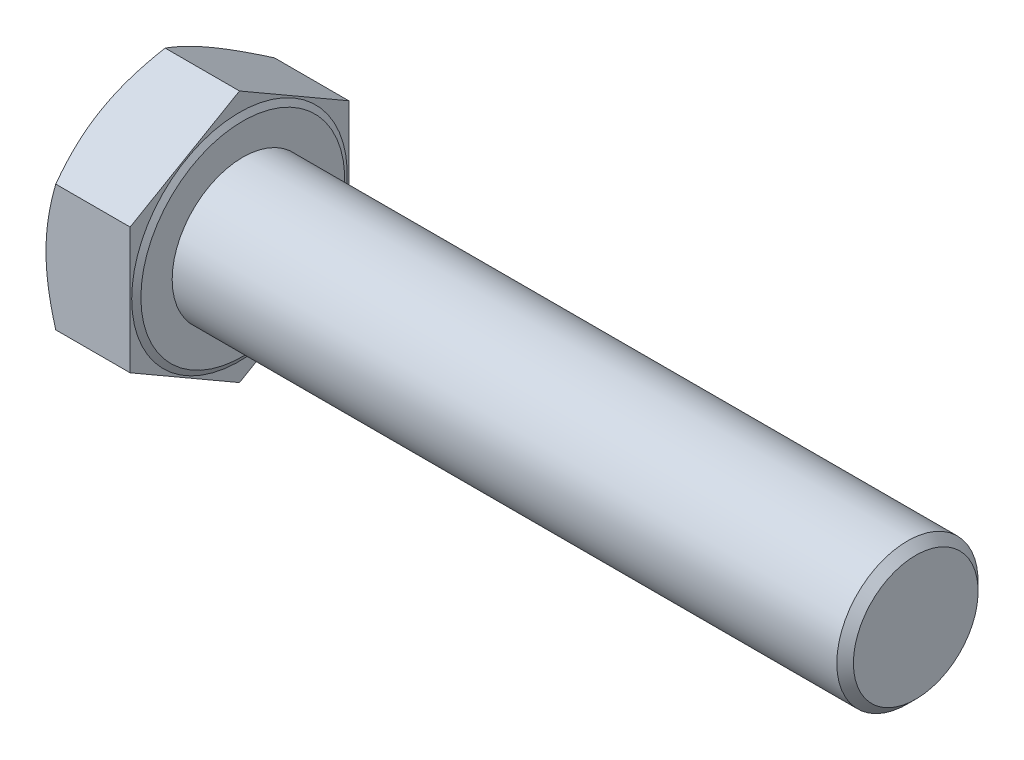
ISO-10303-21;
HEADER;
FILE_DESCRIPTION(('STEP AP214'),'2;1');
FILE_NAME('part.step','',(''),(''),'','','');
FILE_SCHEMA(('AUTOMOTIVE_DESIGN { 1 0 10303 214 1 1 1 1 }'));
ENDSEC;
DATA;
#1=APPLICATION_CONTEXT('core data for automotive mechanical design processes');
#2=APPLICATION_PROTOCOL_DEFINITION('international standard','automotive_design',2000,#1);
#3=PRODUCT_CONTEXT('',#1,'mechanical');
#4=PRODUCT('Part','Part','',(#3));
#5=PRODUCT_RELATED_PRODUCT_CATEGORY('part','',(#4));
#6=PRODUCT_DEFINITION_FORMATION('','',#4);
#7=PRODUCT_DEFINITION_CONTEXT('part definition',#1,'design');
#8=PRODUCT_DEFINITION('design','',#6,#7);
#9=PRODUCT_DEFINITION_SHAPE('','',#8);
#10=(LENGTH_UNIT() NAMED_UNIT(*) SI_UNIT(.MILLI.,.METRE.));
#11=(NAMED_UNIT(*) PLANE_ANGLE_UNIT() SI_UNIT($,.RADIAN.));
#12=(NAMED_UNIT(*) SI_UNIT($,.STERADIAN.) SOLID_ANGLE_UNIT());
#13=UNCERTAINTY_MEASURE_WITH_UNIT(LENGTH_MEASURE(1.E-05),#10,'distance_accuracy_value','');
#14=(GEOMETRIC_REPRESENTATION_CONTEXT(3) GLOBAL_UNCERTAINTY_ASSIGNED_CONTEXT((#13)) GLOBAL_UNIT_ASSIGNED_CONTEXT((#10,
#11,#12)) REPRESENTATION_CONTEXT('',''));
#15=CARTESIAN_POINT('',(0.,0.,0.));
#16=DIRECTION('',(0.,0.,1.));
#17=DIRECTION('',(1.,0.,0.));
#18=AXIS2_PLACEMENT_3D('',#15,#16,#17);
#19=CARTESIAN_POINT('',(26.,37.5277674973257,0.));
#20=DIRECTION('',(1.,0.,0.));
#21=DIRECTION('',(0.,0.,-1.));
#22=AXIS2_PLACEMENT_3D('',#19,#20,#21);
#23=PLANE('',#22);
#24=CARTESIAN_POINT('',(26.,0.,0.));
#25=DIRECTION('',(1.,0.,0.));
#26=DIRECTION('',(0.,0.,-1.));
#27=AXIS2_PLACEMENT_3D('',#24,#25,#26);
#28=CIRCLE('',#27,21.);
#29=CARTESIAN_POINT('',(26.,0.,-21.));
#30=VERTEX_POINT('',#29);
#31=EDGE_CURVE('E251',#30,#30,#28,.F.);
#32=ORIENTED_EDGE('',*,*,#31,.T.);
#33=EDGE_LOOP('',(#32));
#34=FACE_BOUND('',#33,.T.);
#35=CARTESIAN_POINT('',(26.,0.,0.));
#36=DIRECTION('',(-1.,0.,0.));
#37=DIRECTION('',(0.,0.,1.));
#38=AXIS2_PLACEMENT_3D('',#35,#36,#37);
#39=CIRCLE('',#38,30.3);
#40=CARTESIAN_POINT('',(26.,0.,30.3));
#41=VERTEX_POINT('',#40);
#42=EDGE_CURVE('E275',#41,#41,#39,.T.);
#43=ORIENTED_EDGE('',*,*,#42,.F.);
#44=EDGE_LOOP('',(#43));
#45=FACE_BOUND('',#44,.T.);
#46=ADVANCED_FACE('F32',(#34,#45),#23,.T.);
#47=CARTESIAN_POINT('',(0.,0.,0.));
#48=DIRECTION('',(-1.,0.,0.));
#49=DIRECTION('',(0.,0.,1.));
#50=AXIS2_PLACEMENT_3D('',#47,#48,#49);
#51=CYLINDRICAL_SURFACE('',#50,21.);
#52=ORIENTED_EDGE('',*,*,#31,.F.);
#53=EDGE_LOOP('',(#52));
#54=FACE_BOUND('',#53,.T.);
#55=CARTESIAN_POINT('',(223.533,0.,0.));
#56=DIRECTION('',(-1.,0.,0.));
#57=DIRECTION('',(0.,0.,1.));
#58=AXIS2_PLACEMENT_3D('',#55,#56,#57);
#59=CIRCLE('',#58,21.);
#60=CARTESIAN_POINT('',(223.533,0.,21.));
#61=VERTEX_POINT('',#60);
#62=EDGE_CURVE('E246',#61,#61,#59,.T.);
#63=ORIENTED_EDGE('',*,*,#62,.T.);
#64=EDGE_LOOP('',(#63));
#65=FACE_BOUND('',#64,.T.);
#66=ADVANCED_FACE('F232',(#54,#65),#51,.T.);
#67=CARTESIAN_POINT('',(226.,0.,0.));
#68=DIRECTION('',(-1.,0.,0.));
#69=DIRECTION('',(0.,0.,1.));
#70=AXIS2_PLACEMENT_3D('',#67,#68,#69);
#71=CONICAL_SURFACE('',#70,18.533,0.78539816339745);
#72=ORIENTED_EDGE('',*,*,#62,.F.);
#73=EDGE_LOOP('',(#72));
#74=FACE_BOUND('',#73,.T.);
#75=CARTESIAN_POINT('',(226.,0.,0.));
#76=DIRECTION('',(-1.,0.,0.));
#77=DIRECTION('',(0.,0.,1.));
#78=AXIS2_PLACEMENT_3D('',#75,#76,#77);
#79=CIRCLE('',#78,18.533);
#80=CARTESIAN_POINT('',(226.,0.,18.533));
#81=VERTEX_POINT('',#80);
#82=EDGE_CURVE('E249',#81,#81,#79,.T.);
#83=ORIENTED_EDGE('',*,*,#82,.T.);
#84=EDGE_LOOP('',(#83));
#85=FACE_BOUND('',#84,.T.);
#86=ADVANCED_FACE('F235',(#74,#85),#71,.T.);
#87=CARTESIAN_POINT('',(226.,0.,0.));
#88=DIRECTION('',(-1.,0.,0.));
#89=DIRECTION('',(0.,0.,1.));
#90=AXIS2_PLACEMENT_3D('',#87,#88,#89);
#91=PLANE('',#90);
#92=ORIENTED_EDGE('',*,*,#82,.F.);
#93=EDGE_LOOP('',(#92));
#94=FACE_BOUND('',#93,.T.);
#95=ADVANCED_FACE('F200',(#94),#91,.F.);
#96=CARTESIAN_POINT('',(25.,32.0320508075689,0.));
#97=DIRECTION('',(1.,0.,0.));
#98=DIRECTION('',(0.,0.,-1.));
#99=AXIS2_PLACEMENT_3D('',#96,#97,#98);
#100=PLANE('',#99);
#101=CARTESIAN_POINT('',(25.,0.,0.));
#102=DIRECTION('',(-1.,0.,0.));
#103=DIRECTION('',(0.,0.,1.));
#104=AXIS2_PLACEMENT_3D('',#101,#102,#103);
#105=CIRCLE('',#104,32.0320508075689);
#106=CARTESIAN_POINT('',(25.,0.,32.0320508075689));
#107=VERTEX_POINT('',#106);
#108=EDGE_CURVE('E272',#107,#107,#105,.T.);
#109=ORIENTED_EDGE('',*,*,#108,.T.);
#110=EDGE_LOOP('',(#109));
#111=FACE_BOUND('',#110,.T.);
#112=DIRECTION('',(0.,0.500000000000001,0.866025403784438));
#113=VECTOR('',#112,1.);
#114=CARTESIAN_POINT('',(25.,18.7638837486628,-32.5));
#115=LINE('',#114,#113);
#116=CARTESIAN_POINT('',(25.,18.7638837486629,-32.5));
#117=VERTEX_POINT('',#116);
#118=CARTESIAN_POINT('',(25.,37.5277674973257,0.));
#119=VERTEX_POINT('',#118);
#120=EDGE_CURVE('E109',#117,#119,#115,.T.);
#121=ORIENTED_EDGE('',*,*,#120,.T.);
#122=DIRECTION('',(0.,-0.500000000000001,0.866025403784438));
#123=VECTOR('',#122,1.);
#124=CARTESIAN_POINT('',(25.,37.5277674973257,0.));
#125=LINE('',#124,#123);
#126=CARTESIAN_POINT('',(25.,18.7638837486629,32.5));
#127=VERTEX_POINT('',#126);
#128=EDGE_CURVE('E103',#119,#127,#125,.T.);
#129=ORIENTED_EDGE('',*,*,#128,.T.);
#130=DIRECTION('',(0.,-1.,0.));
#131=VECTOR('',#130,1.);
#132=CARTESIAN_POINT('',(25.,18.7638837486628,32.5));
#133=LINE('',#132,#131);
#134=CARTESIAN_POINT('',(25.,-18.7638837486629,32.5));
#135=VERTEX_POINT('',#134);
#136=EDGE_CURVE('E106',#127,#135,#133,.T.);
#137=ORIENTED_EDGE('',*,*,#136,.T.);
#138=DIRECTION('',(0.,-0.500000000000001,-0.866025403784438));
#139=VECTOR('',#138,1.);
#140=CARTESIAN_POINT('',(25.,-37.5277674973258,0.));
#141=LINE('',#140,#139);
#142=CARTESIAN_POINT('',(25.,-37.5277674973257,-1.35308431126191E-13));
#143=VERTEX_POINT('',#142);
#144=EDGE_CURVE('E122',#135,#143,#141,.T.);
#145=ORIENTED_EDGE('',*,*,#144,.T.);
#146=DIRECTION('',(0.,0.500000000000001,-0.866025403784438));
#147=VECTOR('',#146,1.);
#148=CARTESIAN_POINT('',(25.,-18.7638837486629,-32.5));
#149=LINE('',#148,#147);
#150=CARTESIAN_POINT('',(25.,-18.7638837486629,-32.5));
#151=VERTEX_POINT('',#150);
#152=EDGE_CURVE('E47',#143,#151,#149,.T.);
#153=ORIENTED_EDGE('',*,*,#152,.T.);
#154=DIRECTION('',(0.,1.,0.));
#155=VECTOR('',#154,1.);
#156=CARTESIAN_POINT('',(25.,18.7638837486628,-32.5));
#157=LINE('',#156,#155);
#158=EDGE_CURVE('E11',#151,#117,#157,.T.);
#159=ORIENTED_EDGE('',*,*,#158,.T.);
#160=EDGE_LOOP('',(#121,#129,#137,#145,#153,#159));
#161=FACE_BOUND('',#160,.T.);
#162=ADVANCED_FACE('F105',(#111,#161),#100,.T.);
#163=CARTESIAN_POINT('',(25.,0.,0.));
#164=DIRECTION('',(-1.,0.,0.));
#165=DIRECTION('',(0.,0.,1.));
#166=AXIS2_PLACEMENT_3D('',#163,#164,#165);
#167=CONICAL_SURFACE('',#166,32.0320508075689,1.0471975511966);
#168=ORIENTED_EDGE('',*,*,#42,.T.);
#169=EDGE_LOOP('',(#168));
#170=FACE_BOUND('',#169,.T.);
#171=ORIENTED_EDGE('',*,*,#108,.F.);
#172=EDGE_LOOP('',(#171));
#173=FACE_BOUND('',#172,.T.);
#174=ADVANCED_FACE('F229',(#170,#173),#167,.T.);
#175=CARTESIAN_POINT('',(0.,37.5277674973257,0.));
#176=DIRECTION('',(1.,0.,0.));
#177=DIRECTION('',(0.,0.,-1.));
#178=AXIS2_PLACEMENT_3D('',#175,#176,#177);
#179=PLANE('',#178);
#180=CARTESIAN_POINT('',(0.,0.,0.));
#181=DIRECTION('',(1.,0.,0.));
#182=DIRECTION('',(0.,0.,-1.));
#183=AXIS2_PLACEMENT_3D('',#180,#181,#182);
#184=CIRCLE('',#183,32.5000000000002);
#185=CARTESIAN_POINT('',(0.,0.,-32.5));
#186=VERTEX_POINT('',#185);
#187=CARTESIAN_POINT('',(0.,28.1458256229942,-16.25));
#188=VERTEX_POINT('',#187);
#189=EDGE_CURVE('E41',#186,#188,#184,.T.);
#190=ORIENTED_EDGE('',*,*,#189,.F.);
#191=CARTESIAN_POINT('',(0.,-28.1458256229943,-16.2500000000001));
#192=VERTEX_POINT('',#191);
#193=EDGE_CURVE('E130',#192,#186,#184,.T.);
#194=ORIENTED_EDGE('',*,*,#193,.F.);
#195=CARTESIAN_POINT('',(0.,-28.1458256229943,16.2500000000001));
#196=VERTEX_POINT('',#195);
#197=EDGE_CURVE('E136',#196,#192,#184,.T.);
#198=ORIENTED_EDGE('',*,*,#197,.F.);
#199=CARTESIAN_POINT('',(0.,0.,32.5));
#200=VERTEX_POINT('',#199);
#201=EDGE_CURVE('E142',#200,#196,#184,.T.);
#202=ORIENTED_EDGE('',*,*,#201,.F.);
#203=CARTESIAN_POINT('',(0.,28.1458256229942,16.25));
#204=VERTEX_POINT('',#203);
#205=EDGE_CURVE('E147',#204,#200,#184,.T.);
#206=ORIENTED_EDGE('',*,*,#205,.F.);
#207=EDGE_CURVE('E143',#188,#204,#184,.T.);
#208=ORIENTED_EDGE('',*,*,#207,.F.);
#209=EDGE_LOOP('',(#190,#194,#198,#202,#206,#208));
#210=FACE_BOUND('',#209,.T.);
#211=ADVANCED_FACE('F161',(#210),#179,.F.);
#212=CARTESIAN_POINT('',(-8.12500000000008,0.,0.));
#213=DIRECTION('',(1.,0.,0.));
#214=DIRECTION('',(0.,0.,-1.));
#215=AXIS2_PLACEMENT_3D('',#212,#213,#214);
#216=CONICAL_SURFACE('',#215,18.4270871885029,1.0471975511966);
#217=CARTESIAN_POINT('',(2.90284958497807,37.5278829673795,0.0002));
#218=CARTESIAN_POINT('',(2.66475598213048,37.1154613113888,-0.714135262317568));
#219=CARTESIAN_POINT('',(2.4374668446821,36.7014309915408,-1.43125681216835));
#220=CARTESIAN_POINT('',(2.00750073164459,35.8700503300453,-2.87125035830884));
#221=CARTESIAN_POINT('',(1.8048318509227,35.452698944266,-3.59412416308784));
#222=CARTESIAN_POINT('',(1.42682655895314,34.6138606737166,-5.04703466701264));
#223=CARTESIAN_POINT('',(1.25155541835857,34.1923663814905,-5.77708419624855));
#224=CARTESIAN_POINT('',(0.932121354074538,33.3464669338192,-7.24222501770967));
#225=CARTESIAN_POINT('',(0.787955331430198,32.9220620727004,-7.97731580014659));
#226=CARTESIAN_POINT('',(0.536851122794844,32.0811895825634,-9.43374967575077));
#227=CARTESIAN_POINT('',(0.429082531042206,31.6647843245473,-10.1549847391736));
#228=CARTESIAN_POINT('',(0.248379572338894,30.8300658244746,-11.6007595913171));
#229=CARTESIAN_POINT('',(0.175445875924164,30.4117525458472,-12.3252994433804));
#230=CARTESIAN_POINT('',(0.066254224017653,29.5744233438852,-13.7755961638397));
#231=CARTESIAN_POINT('',(0.0299526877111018,29.1554088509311,-14.5013505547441));
#232=CARTESIAN_POINT('',(-0.00519390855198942,28.3169931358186,-15.9535291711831));
#233=CARTESIAN_POINT('',(-0.00404012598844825,27.8975919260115,-16.6799533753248));
#234=CARTESIAN_POINT('',(0.033107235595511,27.113517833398,-18.0380095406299));
#235=CARTESIAN_POINT('',(0.0645710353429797,26.7487890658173,-18.6697382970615));
#236=CARTESIAN_POINT('',(0.155228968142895,26.020201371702,-19.9316892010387));
#237=CARTESIAN_POINT('',(0.2144227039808,25.6563424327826,-20.5619113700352));
#238=CARTESIAN_POINT('',(0.359511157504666,24.9296331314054,-21.8206088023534));
#239=CARTESIAN_POINT('',(0.445430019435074,24.5667839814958,-22.4490819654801));
#240=CARTESIAN_POINT('',(0.642461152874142,23.8428103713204,-23.7030410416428));
#241=CARTESIAN_POINT('',(0.753573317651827,23.4816859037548,-24.3285269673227));
#242=CARTESIAN_POINT('',(1.00194725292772,22.7534948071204,-25.5897909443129));
#243=CARTESIAN_POINT('',(1.13973212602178,22.3864729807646,-26.2254913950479));
#244=CARTESIAN_POINT('',(1.43777540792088,21.654675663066,-27.4930015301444));
#245=CARTESIAN_POINT('',(1.59803686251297,21.2899004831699,-28.1248106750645));
#246=CARTESIAN_POINT('',(1.93860807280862,20.5634518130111,-29.3830566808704));
#247=CARTESIAN_POINT('',(2.11887859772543,20.2017737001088,-30.0095015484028));
#248=CARTESIAN_POINT('',(2.49766949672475,19.4809190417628,-31.2580584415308));
#249=CARTESIAN_POINT('',(2.69618472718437,19.1217418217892,-31.8801716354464));
#250=CARTESIAN_POINT('',(2.90284958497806,18.763768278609,-32.5002));
#251=B_SPLINE_CURVE_WITH_KNOTS('',3,(#217,#218,#219,#220,#221,#222,#223,#224,#225,#226,#227,
#228,#229,#230,#231,#232,#233,#234,#235,#236,#237,#238,#239,#240,#241,#242,#243,#244,#245,#246,
#247,#248,#249,#250),.UNSPECIFIED.,.F.,.F.,(4,2,2,2,2,2,2,2,2,2,2,2,2,2,2,2,4),(0.,
2.57562469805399,5.15209395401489,7.73461063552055,10.316869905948,12.8354474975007,
15.3540735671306,17.8696997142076,20.3852481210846,22.5751277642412,24.7649760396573,
26.9568084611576,29.1486315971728,31.3888387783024,33.6293498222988,35.865543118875,
38.1011079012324),.UNSPECIFIED.);
#252=CARTESIAN_POINT('',(2.90278291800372,37.5277674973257,0.));
#253=VERTEX_POINT('',#252);
#254=EDGE_CURVE('E55',#253,#188,#251,.T.);
#255=ORIENTED_EDGE('',*,*,#254,.T.);
#256=ORIENTED_EDGE('',*,*,#207,.T.);
#257=CARTESIAN_POINT('',(2.90284958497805,18.763768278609,32.5002));
#258=CARTESIAN_POINT('',(2.66475598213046,19.1761899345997,31.7858647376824));
#259=CARTESIAN_POINT('',(2.43746684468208,19.5902202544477,31.0687431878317));
#260=CARTESIAN_POINT('',(2.00750073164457,20.4216009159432,29.6287496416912));
#261=CARTESIAN_POINT('',(1.80483185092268,20.8389523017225,28.9058758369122));
#262=CARTESIAN_POINT('',(1.42682655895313,21.6777905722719,27.4529653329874));
#263=CARTESIAN_POINT('',(1.25155541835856,22.099284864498,26.7229158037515));
#264=CARTESIAN_POINT('',(0.932121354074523,22.9451843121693,25.2577749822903));
#265=CARTESIAN_POINT('',(0.787955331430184,23.3695891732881,24.5226841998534));
#266=CARTESIAN_POINT('',(0.536851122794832,24.2104616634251,23.0662503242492));
#267=CARTESIAN_POINT('',(0.429082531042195,24.6268669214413,22.3450152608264));
#268=CARTESIAN_POINT('',(0.248379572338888,25.4615854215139,20.8992404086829));
#269=CARTESIAN_POINT('',(0.175445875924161,25.8798987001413,20.1747005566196));
#270=CARTESIAN_POINT('',(0.0662542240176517,26.7172279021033,18.7244038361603));
#271=CARTESIAN_POINT('',(0.0299526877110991,27.1362423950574,17.9986494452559));
#272=CARTESIAN_POINT('',(-0.00519390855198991,27.9746581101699,16.5464708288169));
#273=CARTESIAN_POINT('',(-0.00404012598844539,28.394059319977,15.8200466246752));
#274=CARTESIAN_POINT('',(0.0331072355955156,29.1781334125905,14.4619904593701));
#275=CARTESIAN_POINT('',(0.0645710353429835,29.5428621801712,13.8302617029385));
#276=CARTESIAN_POINT('',(0.1552289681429,30.2714498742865,12.5683107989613));
#277=CARTESIAN_POINT('',(0.214422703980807,30.6353088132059,11.9380886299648));
#278=CARTESIAN_POINT('',(0.359511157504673,31.3620181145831,10.6793911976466));
#279=CARTESIAN_POINT('',(0.445430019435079,31.7248672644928,10.0509180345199));
#280=CARTESIAN_POINT('',(0.642461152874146,32.4488408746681,8.79695895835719));
#281=CARTESIAN_POINT('',(0.753573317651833,32.8099653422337,8.1714730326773));
#282=CARTESIAN_POINT('',(1.00194725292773,33.5381564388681,6.91020905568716));
#283=CARTESIAN_POINT('',(1.1397321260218,33.9051782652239,6.27450860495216));
#284=CARTESIAN_POINT('',(1.4377754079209,34.6369755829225,5.00699846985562));
#285=CARTESIAN_POINT('',(1.59803686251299,35.0017507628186,4.37518932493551));
#286=CARTESIAN_POINT('',(1.93860807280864,35.7281994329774,3.1169433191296));
#287=CARTESIAN_POINT('',(2.11887859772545,36.0898775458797,2.49049845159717));
#288=CARTESIAN_POINT('',(2.49766949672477,36.8107322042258,1.24194155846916));
#289=CARTESIAN_POINT('',(2.69618472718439,37.1699094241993,0.619828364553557));
#290=CARTESIAN_POINT('',(2.90284958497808,37.5278829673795,-0.000200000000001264));
#291=B_SPLINE_CURVE_WITH_KNOTS('',3,(#257,#258,#259,#260,#261,#262,#263,#264,#265,#266,#267,
#268,#269,#270,#271,#272,#273,#274,#275,#276,#277,#278,#279,#280,#281,#282,#283,#284,#285,#286,
#287,#288,#289,#290),.UNSPECIFIED.,.F.,.F.,(4,2,2,2,2,2,2,2,2,2,2,2,2,2,2,2,4),(0.,
2.57562469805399,5.15209395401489,7.73461063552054,10.316869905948,12.8354474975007,
15.3540735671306,17.8696997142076,20.3852481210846,22.5751277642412,24.7649760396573,
26.9568084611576,29.1486315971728,31.3888387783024,33.6293498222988,35.8655431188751,
38.1011079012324),.UNSPECIFIED.);
#292=EDGE_CURVE('E253',#204,#253,#291,.T.);
#293=ORIENTED_EDGE('',*,*,#292,.T.);
#294=EDGE_LOOP('',(#255,#256,#293));
#295=FACE_BOUND('',#294,.T.);
#296=ADVANCED_FACE('F192',(#295),#216,.T.);
#297=CARTESIAN_POINT('',(2.9027829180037,18.7638837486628,32.5));
#298=VERTEX_POINT('',#297);
#299=EDGE_CURVE('E127',#298,#204,#291,.T.);
#300=ORIENTED_EDGE('',*,*,#299,.T.);
#301=ORIENTED_EDGE('',*,*,#205,.T.);
#302=CARTESIAN_POINT('',(15.9047865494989,-50.4925747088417,32.5));
#303=CARTESIAN_POINT('',(15.5600668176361,-49.7824910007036,32.5));
#304=CARTESIAN_POINT('',(15.2170543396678,-49.071576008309,32.5));
#305=CARTESIAN_POINT('',(14.5348412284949,-47.6479111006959,32.5));
#306=CARTESIAN_POINT('',(14.1956406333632,-46.9351611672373,32.5));
#307=CARTESIAN_POINT('',(13.5214037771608,-45.5075586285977,32.5));
#308=CARTESIAN_POINT('',(13.186368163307,-44.7927057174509,32.5));
#309=CARTESIAN_POINT('',(12.5209924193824,-43.3608209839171,32.5));
#310=CARTESIAN_POINT('',(12.1906522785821,-42.6437891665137,32.5));
#311=CARTESIAN_POINT('',(11.203903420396,-40.4813440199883,32.5));
#312=CARTESIAN_POINT('',(10.5554240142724,-39.0322974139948,32.5));
#313=CARTESIAN_POINT('',(9.28484450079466,-36.1227068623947,32.5));
#314=CARTESIAN_POINT('',(8.66274315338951,-34.6621634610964,32.5));
#315=CARTESIAN_POINT('',(7.74487980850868,-32.4372230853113,32.5));
#316=CARTESIAN_POINT('',(7.43684387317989,-31.677884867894,32.5));
#317=CARTESIAN_POINT('',(6.83090400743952,-30.1551664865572,32.5));
#318=CARTESIAN_POINT('',(6.53300009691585,-29.3917863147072,32.5));
#319=CARTESIAN_POINT('',(5.94865765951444,-27.8605310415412,32.5));
#320=CARTESIAN_POINT('',(5.6622205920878,-27.0926553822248,32.5));
#321=CARTESIAN_POINT('',(5.10243670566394,-25.5521437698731,32.5));
#322=CARTESIAN_POINT('',(4.82908983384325,-24.7795078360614,32.5));
#323=CARTESIAN_POINT('',(4.29782532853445,-23.23068112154,32.5));
#324=CARTESIAN_POINT('',(4.03987743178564,-22.454500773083,32.5));
#325=CARTESIAN_POINT('',(3.54085716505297,-20.8967493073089,32.5));
#326=CARTESIAN_POINT('',(3.29978508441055,-20.115178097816,32.5));
#327=CARTESIAN_POINT('',(2.60534917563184,-17.7623353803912,32.5));
#328=CARTESIAN_POINT('',(2.18055976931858,-16.1823446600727,32.5));
#329=CARTESIAN_POINT('',(1.61715989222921,-13.7996814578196,32.5));
#330=CARTESIAN_POINT('',(1.44203917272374,-13.0055523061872,32.5));
#331=CARTESIAN_POINT('',(1.11846779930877,-11.4118441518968,32.5));
#332=CARTESIAN_POINT('',(0.970016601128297,-10.6122652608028,32.5));
#333=CARTESIAN_POINT('',(0.702401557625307,-9.00822572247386,32.5));
#334=CARTESIAN_POINT('',(0.583236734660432,-8.20376523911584,32.5));
#335=CARTESIAN_POINT('',(0.376560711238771,-6.59075961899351,32.5));
#336=CARTESIAN_POINT('',(0.289049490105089,-5.78221448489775,32.5));
#337=CARTESIAN_POINT('',(0.148528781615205,-4.17281192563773,32.5));
#338=CARTESIAN_POINT('',(0.0950813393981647,-3.37199296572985,32.5));
#339=CARTESIAN_POINT('',(0.0221059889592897,-1.7688115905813,32.5));
#340=CARTESIAN_POINT('',(0.00257751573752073,-0.966449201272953,32.5));
#341=CARTESIAN_POINT('',(-0.00209950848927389,0.638376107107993,32.5));
#342=CARTESIAN_POINT('',(0.012752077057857,1.44083902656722,32.5));
#343=CARTESIAN_POINT('',(0.0764882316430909,3.04445124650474,32.5));
#344=CARTESIAN_POINT('',(0.125374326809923,3.84560048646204,32.5));
#345=CARTESIAN_POINT('',(0.236570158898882,5.2068161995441,32.5));
#346=CARTESIAN_POINT('',(0.290538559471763,5.76758113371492,32.5));
#347=CARTESIAN_POINT('',(0.414090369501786,6.88739454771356,32.5));
#348=CARTESIAN_POINT('',(0.483674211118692,7.44644297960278,32.5));
#349=CARTESIAN_POINT('',(0.714834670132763,9.12057700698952,32.5));
#350=CARTESIAN_POINT('',(0.898817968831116,10.2326244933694,32.5));
#351=CARTESIAN_POINT('',(1.32002620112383,12.4473098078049,32.5));
#352=CARTESIAN_POINT('',(1.55729244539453,13.5499396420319,32.5));
#353=CARTESIAN_POINT('',(2.07781220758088,15.7441916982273,32.5));
#354=CARTESIAN_POINT('',(2.3610650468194,16.8358140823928,32.5));
#355=CARTESIAN_POINT('',(2.97335703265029,19.032031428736,32.5));
#356=CARTESIAN_POINT('',(3.30326826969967,20.1363814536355,32.5));
#357=CARTESIAN_POINT('',(3.9973427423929,22.3342031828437,32.5));
#358=CARTESIAN_POINT('',(4.36150620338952,23.4276748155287,32.5));
#359=CARTESIAN_POINT('',(5.11828991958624,25.6042852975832,32.5));
#360=CARTESIAN_POINT('',(5.51090080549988,26.6874274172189,32.5));
#361=CARTESIAN_POINT('',(6.11768362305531,28.3053873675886,32.5));
#362=CARTESIAN_POINT('',(6.32292229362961,28.8435817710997,32.5));
#363=CARTESIAN_POINT('',(6.73885829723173,29.9178607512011,32.5));
#364=CARTESIAN_POINT('',(6.94955564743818,30.4539453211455,32.5));
#365=CARTESIAN_POINT('',(7.45278104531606,31.71700214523,32.5));
#366=CARTESIAN_POINT('',(7.74743020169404,32.4431292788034,32.5));
#367=CARTESIAN_POINT('',(8.34491872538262,33.8920096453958,32.5));
#368=CARTESIAN_POINT('',(8.64775819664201,34.6147628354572,32.5));
#369=CARTESIAN_POINT('',(9.56719134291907,36.7784563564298,32.5));
#370=CARTESIAN_POINT('',(10.1946769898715,38.2147739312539,32.5));
#371=CARTESIAN_POINT('',(11.4728437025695,41.0773847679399,32.5));
#372=CARTESIAN_POINT('',(12.1235299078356,42.5036757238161,32.5));
#373=CARTESIAN_POINT('',(13.4434602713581,45.3475925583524,32.5));
#374=CARTESIAN_POINT('',(14.1127040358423,46.7652186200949,32.5));
#375=CARTESIAN_POINT('',(15.4670260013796,49.5947765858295,32.5));
#376=CARTESIAN_POINT('',(16.1521207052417,51.0067005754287,32.5));
#377=CARTESIAN_POINT('',(17.5347401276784,53.8244487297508,32.5));
#378=CARTESIAN_POINT('',(18.2322648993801,55.2302728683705,32.5));
#379=CARTESIAN_POINT('',(19.6375344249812,58.0365768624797,32.5));
#380=CARTESIAN_POINT('',(20.3452778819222,59.43705736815,32.5));
#381=CARTESIAN_POINT('',(21.7693916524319,62.2336183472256,32.5));
#382=CARTESIAN_POINT('',(22.4857619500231,63.629698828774,32.5));
#383=CARTESIAN_POINT('',(23.8656541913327,66.3016487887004,32.5));
#384=CARTESIAN_POINT('',(24.5285928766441,67.5778197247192,32.5));
#385=CARTESIAN_POINT('',(25.8597528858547,70.1274049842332,32.5));
#386=CARTESIAN_POINT('',(26.5279742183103,71.4008193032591,32.5));
#387=CARTESIAN_POINT('',(27.8690223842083,73.945273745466,32.5));
#388=CARTESIAN_POINT('',(28.541849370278,75.2163137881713,32.5));
#389=CARTESIAN_POINT('',(29.8915049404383,77.7562677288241,32.5));
#390=CARTESIAN_POINT('',(30.5683335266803,79.025181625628,32.5));
#391=CARTESIAN_POINT('',(31.9238119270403,81.5579711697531,32.5));
#392=CARTESIAN_POINT('',(32.6024530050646,82.8218514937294,32.5));
#393=CARTESIAN_POINT('',(33.9628190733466,85.3479515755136,32.5));
#394=CARTESIAN_POINT('',(34.6445440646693,86.6101713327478,32.5));
#395=CARTESIAN_POINT('',(36.0106878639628,89.1330620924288,32.5));
#396=CARTESIAN_POINT('',(36.6951065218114,90.3937331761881,32.5));
#397=CARTESIAN_POINT('',(38.066383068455,92.9137455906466,32.5));
#398=CARTESIAN_POINT('',(38.7532409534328,94.1730869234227,32.5));
#399=CARTESIAN_POINT('',(39.4411736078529,95.4318401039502,32.5));
#400=B_SPLINE_CURVE_WITH_KNOTS('',3,(#302,#303,#304,#305,#306,#307,#308,#309,#310,#311,#312,
#313,#314,#315,#316,#317,#318,#319,#320,#321,#322,#323,#324,#325,#326,#327,#328,#329,#330,#331,
#332,#333,#334,#335,#336,#337,#338,#339,#340,#341,#342,#343,#344,#345,#346,#347,#348,#349,#350,
#351,#352,#353,#354,#355,#356,#357,#358,#359,#360,#361,#362,#363,#364,#365,#366,#367,#368,#369,
#370,#371,#372,#373,#374,#375,#376,#377,#378,#379,#380,#381,#382,#383,#384,#385,#386,#387,#388,
#389,#390,#391,#392,#393,#394,#395,#396,#397,#398,#399),.UNSPECIFIED.,.F.,.F.,(4,2,2,2,2,2,2,2,
2,2,2,2,2,2,2,2,2,2,2,2,2,2,2,2,2,2,2,2,2,2,2,2,2,2,2,2,2,2,2,2,2,2,2,2,2,2,2,2,4),(0.,
2.36800745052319,4.73603853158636,7.10443310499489,9.47282226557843,14.2352166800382,
18.9973869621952,21.4556455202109,23.9139089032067,26.3724841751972,28.8310495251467,
31.2846122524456,33.7382170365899,38.6435530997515,41.0828192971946,43.5220357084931,
45.961170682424,48.4003040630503,50.807409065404,53.2144739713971,55.6215484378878,
58.0287308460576,59.7185836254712,61.4084831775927,64.7883629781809,68.1708723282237,
71.5533317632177,75.0103968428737,78.4674846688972,81.9234390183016,83.6514159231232,
85.3793982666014,87.7302338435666,90.0810992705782,94.7830134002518,99.4859756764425,
104.188838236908,108.896839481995,113.604860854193,118.312289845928,123.019710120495,
127.333963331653,131.64822353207,135.962627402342,140.277033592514,144.580692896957,
148.8843536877,153.187777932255,157.491195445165),.UNSPECIFIED.);
#401=EDGE_CURVE('E171',#200,#298,#400,.T.);
#402=ORIENTED_EDGE('',*,*,#401,.T.);
#403=EDGE_LOOP('',(#300,#301,#402));
#404=FACE_BOUND('',#403,.T.);
#405=ADVANCED_FACE('F197',(#404),#216,.T.);
#406=CARTESIAN_POINT('',(2.90278291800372,-18.7638837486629,32.5));
#407=VERTEX_POINT('',#406);
#408=EDGE_CURVE('E159',#407,#200,#400,.T.);
#409=ORIENTED_EDGE('',*,*,#408,.T.);
#410=ORIENTED_EDGE('',*,*,#201,.T.);
#411=CARTESIAN_POINT('',(2.90284958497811,-37.5278829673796,-0.000199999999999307));
#412=CARTESIAN_POINT('',(2.66475598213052,-37.1154613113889,0.71413526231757));
#413=CARTESIAN_POINT('',(2.43746684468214,-36.7014309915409,1.43125681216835));
#414=CARTESIAN_POINT('',(2.00750073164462,-35.8700503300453,2.87125035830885));
#415=CARTESIAN_POINT('',(1.80483185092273,-35.4526989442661,3.59412416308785));
#416=CARTESIAN_POINT('',(1.42682655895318,-34.6138606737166,5.04703466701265));
#417=CARTESIAN_POINT('',(1.25155541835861,-34.1923663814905,5.77708419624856));
#418=CARTESIAN_POINT('',(0.932121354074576,-33.3464669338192,7.24222501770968));
#419=CARTESIAN_POINT('',(0.787955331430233,-32.9220620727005,7.9773158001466));
#420=CARTESIAN_POINT('',(0.536851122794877,-32.0811895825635,9.43374967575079));
#421=CARTESIAN_POINT('',(0.42908253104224,-31.6647843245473,10.1549847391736));
#422=CARTESIAN_POINT('',(0.248379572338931,-30.8300658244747,11.6007595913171));
#423=CARTESIAN_POINT('',(0.175445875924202,-30.4117525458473,12.3252994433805));
#424=CARTESIAN_POINT('',(0.0662542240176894,-29.5744233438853,13.7755961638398));
#425=CARTESIAN_POINT('',(0.029952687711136,-29.1554088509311,14.5013505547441));
#426=CARTESIAN_POINT('',(-0.00519390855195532,-28.3169931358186,15.9535291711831));
#427=CARTESIAN_POINT('',(-0.00404012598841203,-27.8975919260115,16.6799533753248));
#428=CARTESIAN_POINT('',(0.0331072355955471,-27.113517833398,18.0380095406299));
#429=CARTESIAN_POINT('',(0.0645710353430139,-26.7487890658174,18.6697382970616));
#430=CARTESIAN_POINT('',(0.15522896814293,-26.0202013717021,19.9316892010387));
#431=CARTESIAN_POINT('',(0.214422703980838,-25.6563424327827,20.5619113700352));
#432=CARTESIAN_POINT('',(0.359511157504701,-24.9296331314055,21.8206088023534));
#433=CARTESIAN_POINT('',(0.445430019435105,-24.5667839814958,22.4490819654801));
#434=CARTESIAN_POINT('',(0.642461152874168,-23.8428103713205,23.7030410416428));
#435=CARTESIAN_POINT('',(0.753573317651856,-23.4816859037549,24.3285269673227));
#436=CARTESIAN_POINT('',(1.00194725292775,-22.7534948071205,25.5897909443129));
#437=CARTESIAN_POINT('',(1.13973212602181,-22.3864729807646,26.2254913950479));
#438=CARTESIAN_POINT('',(1.43777540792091,-21.6546756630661,27.4930015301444));
#439=CARTESIAN_POINT('',(1.598036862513,-21.28990048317,28.1248106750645));
#440=CARTESIAN_POINT('',(1.93860807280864,-20.5634518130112,29.3830566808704));
#441=CARTESIAN_POINT('',(2.11887859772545,-20.2017737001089,30.0095015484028));
#442=CARTESIAN_POINT('',(2.49766949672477,-19.4809190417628,31.2580584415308));
#443=CARTESIAN_POINT('',(2.69618472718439,-19.1217418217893,31.8801716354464));
#444=CARTESIAN_POINT('',(2.90284958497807,-18.7637682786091,32.5002));
#445=B_SPLINE_CURVE_WITH_KNOTS('',3,(#411,#412,#413,#414,#415,#416,#417,#418,#419,#420,#421,
#422,#423,#424,#425,#426,#427,#428,#429,#430,#431,#432,#433,#434,#435,#436,#437,#438,#439,#440,
#441,#442,#443,#444),.UNSPECIFIED.,.F.,.F.,(4,2,2,2,2,2,2,2,2,2,2,2,2,2,2,2,4),(0.,
2.57562469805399,5.1520939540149,7.73461063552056,10.316869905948,12.8354474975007,
15.3540735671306,17.8696997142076,20.3852481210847,22.5751277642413,24.7649760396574,
26.9568084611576,29.1486315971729,31.3888387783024,33.6293498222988,35.865543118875,
38.1011079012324),.UNSPECIFIED.);
#446=EDGE_CURVE('E158',#196,#407,#445,.T.);
#447=ORIENTED_EDGE('',*,*,#446,.T.);
#448=EDGE_LOOP('',(#409,#410,#447));
#449=FACE_BOUND('',#448,.T.);
#450=ADVANCED_FACE('F156',(#449),#216,.T.);
#451=CARTESIAN_POINT('',(2.90278291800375,-37.5277674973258,0.));
#452=VERTEX_POINT('',#451);
#453=EDGE_CURVE('E169',#452,#196,#445,.T.);
#454=ORIENTED_EDGE('',*,*,#453,.T.);
#455=ORIENTED_EDGE('',*,*,#197,.T.);
#456=CARTESIAN_POINT('',(2.90284958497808,-18.763768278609,-32.5002));
#457=CARTESIAN_POINT('',(2.66475598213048,-19.1761899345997,-31.7858647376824));
#458=CARTESIAN_POINT('',(2.4374668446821,-19.5902202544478,-31.0687431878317));
#459=CARTESIAN_POINT('',(2.00750073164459,-20.4216009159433,-29.6287496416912));
#460=CARTESIAN_POINT('',(1.8048318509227,-20.8389523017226,-28.9058758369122));
#461=CARTESIAN_POINT('',(1.42682655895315,-21.677790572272,-27.4529653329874));
#462=CARTESIAN_POINT('',(1.25155541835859,-22.0992848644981,-26.7229158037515));
#463=CARTESIAN_POINT('',(0.932121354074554,-22.9451843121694,-25.2577749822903));
#464=CARTESIAN_POINT('',(0.787955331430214,-23.3695891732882,-24.5226841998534));
#465=CARTESIAN_POINT('',(0.536851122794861,-24.2104616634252,-23.0662503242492));
#466=CARTESIAN_POINT('',(0.429082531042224,-24.6268669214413,-22.3450152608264));
#467=CARTESIAN_POINT('',(0.248379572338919,-25.4615854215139,-20.8992404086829));
#468=CARTESIAN_POINT('',(0.175445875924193,-25.8798987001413,-20.1747005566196));
#469=CARTESIAN_POINT('',(0.0662542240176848,-26.7172279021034,-18.7244038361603));
#470=CARTESIAN_POINT('',(0.0299526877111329,-27.1362423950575,-17.9986494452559));
#471=CARTESIAN_POINT('',(-0.00519390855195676,-27.97465811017,-16.5464708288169));
#472=CARTESIAN_POINT('',(-0.00404012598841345,-28.3940593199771,-15.8200466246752));
#473=CARTESIAN_POINT('',(0.0331072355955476,-29.1781334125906,-14.4619904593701));
#474=CARTESIAN_POINT('',(0.0645710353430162,-29.5428621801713,-13.8302617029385));
#475=CARTESIAN_POINT('',(0.155228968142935,-30.2714498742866,-12.5683107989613));
#476=CARTESIAN_POINT('',(0.214422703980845,-30.6353088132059,-11.9380886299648));
#477=CARTESIAN_POINT('',(0.359511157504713,-31.3620181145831,-10.6793911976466));
#478=CARTESIAN_POINT('',(0.445430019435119,-31.7248672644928,-10.0509180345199));
#479=CARTESIAN_POINT('',(0.642461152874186,-32.4488408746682,-8.79695895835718));
#480=CARTESIAN_POINT('',(0.753573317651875,-32.8099653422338,-8.17147303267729));
#481=CARTESIAN_POINT('',(1.00194725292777,-33.5381564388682,-6.91020905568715));
#482=CARTESIAN_POINT('',(1.13973212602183,-33.905178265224,-6.27450860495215));
#483=CARTESIAN_POINT('',(1.43777540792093,-34.6369755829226,-5.00699846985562));
#484=CARTESIAN_POINT('',(1.59803686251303,-35.0017507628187,-4.37518932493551));
#485=CARTESIAN_POINT('',(1.93860807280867,-35.7281994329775,-3.1169433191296));
#486=CARTESIAN_POINT('',(2.11887859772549,-36.0898775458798,-2.49049845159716));
#487=CARTESIAN_POINT('',(2.4976694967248,-36.8107322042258,-1.24194155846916));
#488=CARTESIAN_POINT('',(2.69618472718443,-37.1699094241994,-0.619828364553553));
#489=CARTESIAN_POINT('',(2.90284958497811,-37.5278829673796,0.000200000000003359));
#490=B_SPLINE_CURVE_WITH_KNOTS('',3,(#456,#457,#458,#459,#460,#461,#462,#463,#464,#465,#466,
#467,#468,#469,#470,#471,#472,#473,#474,#475,#476,#477,#478,#479,#480,#481,#482,#483,#484,#485,
#486,#487,#488,#489),.UNSPECIFIED.,.F.,.F.,(4,2,2,2,2,2,2,2,2,2,2,2,2,2,2,2,4),(0.,
2.57562469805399,5.1520939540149,7.73461063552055,10.316869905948,12.8354474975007,
15.3540735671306,17.8696997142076,20.3852481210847,22.5751277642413,24.7649760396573,
26.9568084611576,29.1486315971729,31.3888387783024,33.6293498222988,35.8655431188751,
38.1011079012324),.UNSPECIFIED.);
#491=EDGE_CURVE('E173',#192,#452,#490,.T.);
#492=ORIENTED_EDGE('',*,*,#491,.T.);
#493=EDGE_LOOP('',(#454,#455,#492));
#494=FACE_BOUND('',#493,.T.);
#495=ADVANCED_FACE('F265',(#494),#216,.T.);
#496=CARTESIAN_POINT('',(15.9047865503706,-50.4925747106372,-32.5));
#497=CARTESIAN_POINT('',(15.5600668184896,-49.7824910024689,-32.5));
#498=CARTESIAN_POINT('',(15.2170543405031,-49.0715760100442,-32.5));
#499=CARTESIAN_POINT('',(14.5348412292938,-47.6479111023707,-32.5));
#500=CARTESIAN_POINT('',(14.1956406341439,-46.9351611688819,-32.5));
#501=CARTESIAN_POINT('',(13.5214037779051,-45.5075586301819,-32.5));
#502=CARTESIAN_POINT('',(13.1863681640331,-44.7927057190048,-32.5));
#503=CARTESIAN_POINT('',(12.5209924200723,-43.3608209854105,-32.5));
#504=CARTESIAN_POINT('',(12.1906522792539,-42.6437891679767,-32.5));
#505=CARTESIAN_POINT('',(11.2039034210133,-40.4813440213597,-32.5));
#506=CARTESIAN_POINT('',(10.5554240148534,-39.0322974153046,-32.5));
#507=CARTESIAN_POINT('',(9.28484450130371,-36.1227068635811,-32.5));
#508=CARTESIAN_POINT('',(8.66274315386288,-34.6621634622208,-32.5));
#509=CARTESIAN_POINT('',(7.74487980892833,-32.4372230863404,-32.5));
#510=CARTESIAN_POINT('',(7.43684387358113,-31.6778848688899,-32.5));
#511=CARTESIAN_POINT('',(6.83090400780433,-30.1551664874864,-32.5));
#512=CARTESIAN_POINT('',(6.53300009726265,-29.391786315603,-32.5));
#513=CARTESIAN_POINT('',(5.9486576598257,-27.8605310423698,-32.5));
#514=CARTESIAN_POINT('',(5.66222059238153,-27.0926553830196,-32.5));
#515=CARTESIAN_POINT('',(5.10243670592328,-25.5521437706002,-32.5));
#516=CARTESIAN_POINT('',(4.82908983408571,-24.7795078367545,-32.5));
#517=CARTESIAN_POINT('',(4.29782532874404,-23.2306811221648,-32.5));
#518=CARTESIAN_POINT('',(4.03987743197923,-22.4545007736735,-32.5));
#519=CARTESIAN_POINT('',(3.54085716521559,-20.8967493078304,-32.5));
#520=CARTESIAN_POINT('',(3.2997850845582,-20.1151780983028,-32.5));
#521=CARTESIAN_POINT('',(2.60534917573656,-17.762335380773,-32.5));
#522=CARTESIAN_POINT('',(2.18055976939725,-16.1823446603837,-32.5));
#523=CARTESIAN_POINT('',(1.61715989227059,-13.7996814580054,-32.5));
#524=CARTESIAN_POINT('',(1.44203917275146,-13.0055523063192,-32.5));
#525=CARTESIAN_POINT('',(1.11846779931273,-11.4118441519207,-32.5));
#526=CARTESIAN_POINT('',(0.970016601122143,-10.6122652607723,-32.5));
#527=CARTESIAN_POINT('',(0.702401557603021,-9.00822572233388,-32.5));
#528=CARTESIAN_POINT('',(0.583236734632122,-8.20376523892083,-32.5));
#529=CARTESIAN_POINT('',(0.376560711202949,-6.59075961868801,-32.5));
#530=CARTESIAN_POINT('',(0.28904949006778,-5.78221448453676,-32.5));
#531=CARTESIAN_POINT('',(0.148528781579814,-4.17281192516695,-32.5));
#532=CARTESIAN_POINT('',(0.09508133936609,-3.37199296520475,-32.5));
#533=CARTESIAN_POINT('',(0.022105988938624,-1.76881158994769,-32.5));
#534=CARTESIAN_POINT('',(0.00257751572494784,-0.96644920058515,-32.5));
#535=CARTESIAN_POINT('',(-0.00209950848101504,0.638376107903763,-32.5));
#536=CARTESIAN_POINT('',(0.0127520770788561,1.44083902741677,-32.5));
#537=CARTESIAN_POINT('',(0.0764882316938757,3.04445124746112,-32.5));
#538=CARTESIAN_POINT('',(0.125374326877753,3.84560048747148,-32.5));
#539=CARTESIAN_POINT('',(0.236570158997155,5.20681620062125,-32.5));
#540=CARTESIAN_POINT('',(0.290538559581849,5.767581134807,-32.5));
#541=CARTESIAN_POINT('',(0.414090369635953,6.88739454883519,-32.5));
#542=CARTESIAN_POINT('',(0.48367421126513,7.44644298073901,-32.5));
#543=CARTESIAN_POINT('',(0.714834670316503,9.12057700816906,-32.5));
#544=CARTESIAN_POINT('',(0.89881796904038,10.2326244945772,-32.5));
#545=CARTESIAN_POINT('',(1.32002620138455,12.447309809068,-32.5));
#546=CARTESIAN_POINT('',(1.55729244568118,13.5499396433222,-32.5));
#547=CARTESIAN_POINT('',(2.07781220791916,15.7441916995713,-32.5));
#548=CARTESIAN_POINT('',(2.36106504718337,16.8358140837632,-32.5));
#549=CARTESIAN_POINT('',(2.97335703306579,19.03203143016,-32.5));
#550=CARTESIAN_POINT('',(3.30326827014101,20.1363814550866,-32.5));
#551=CARTESIAN_POINT('',(3.99734274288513,22.3342031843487,-32.5));
#552=CARTESIAN_POINT('',(4.3615062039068,23.4276748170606,-32.5));
#553=CARTESIAN_POINT('',(5.11828992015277,25.6042852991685,-32.5));
#554=CARTESIAN_POINT('',(5.5109008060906,26.6874274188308,-32.5));
#555=CARTESIAN_POINT('',(6.11768362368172,28.3053873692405,-32.5));
#556=CARTESIAN_POINT('',(6.32292229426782,28.843581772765,-32.5));
#557=CARTESIAN_POINT('',(6.73885829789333,29.917860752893,-32.5));
#558=CARTESIAN_POINT('',(6.94955564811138,30.4539453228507,-32.5));
#559=CARTESIAN_POINT('',(7.45278104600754,31.7170021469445,-32.5));
#560=CARTESIAN_POINT('',(7.74743020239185,32.4431292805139,-32.5));
#561=CARTESIAN_POINT('',(8.3449187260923,33.8920096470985,-32.5));
#562=CARTESIAN_POINT('',(8.64775819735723,34.6147628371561,-32.5));
#563=CARTESIAN_POINT('',(9.56719134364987,36.7784563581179,-32.5));
#564=CARTESIAN_POINT('',(10.1946769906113,38.2147739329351,-32.5));
#565=CARTESIAN_POINT('',(11.4728437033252,41.0773847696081,-32.5));
#566=CARTESIAN_POINT('',(12.1235299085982,42.5036757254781,-32.5));
#567=CARTESIAN_POINT('',(13.4434602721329,45.3475925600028,-32.5));
#568=CARTESIAN_POINT('',(14.1127040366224,46.7652186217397,-32.5));
#569=CARTESIAN_POINT('',(15.467026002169,49.5947765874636,-32.5));
#570=CARTESIAN_POINT('',(16.1521207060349,51.0067005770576,-32.5));
#571=CARTESIAN_POINT('',(17.5347401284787,53.8244487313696,-32.5));
#572=CARTESIAN_POINT('',(18.2322649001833,55.2302728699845,-32.5));
#573=CARTESIAN_POINT('',(19.6375344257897,58.0365768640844,-32.5));
#574=CARTESIAN_POINT('',(20.345277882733,59.4370573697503,-32.5));
#575=CARTESIAN_POINT('',(21.7693916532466,62.2336183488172,-32.5));
#576=CARTESIAN_POINT('',(22.4857619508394,63.6296988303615,-32.5));
#577=CARTESIAN_POINT('',(23.8656541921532,66.3016487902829,-32.5));
#578=CARTESIAN_POINT('',(24.5285928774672,67.5778197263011,-32.5));
#579=CARTESIAN_POINT('',(25.8597528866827,70.1274049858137,-32.5));
#580=CARTESIAN_POINT('',(26.5279742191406,71.400819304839,-32.5));
#581=CARTESIAN_POINT('',(27.8690223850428,73.9452737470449,-32.5));
#582=CARTESIAN_POINT('',(28.5418493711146,75.2163137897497,-32.5));
#583=CARTESIAN_POINT('',(29.8915049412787,77.7562677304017,-32.5));
#584=CARTESIAN_POINT('',(30.5683335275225,79.0251816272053,-32.5));
#585=CARTESIAN_POINT('',(31.9238119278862,81.5579711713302,-32.5));
#586=CARTESIAN_POINT('',(32.6024530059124,82.8218514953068,-32.5));
#587=CARTESIAN_POINT('',(33.962819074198,85.3479515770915,-32.5));
#588=CARTESIAN_POINT('',(34.6445440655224,86.610171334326,-32.5));
#589=CARTESIAN_POINT('',(36.0106878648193,89.1330620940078,-32.5));
#590=CARTESIAN_POINT('',(36.6951065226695,90.3937331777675,-32.5));
#591=CARTESIAN_POINT('',(38.0663830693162,92.9137455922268,-32.5));
#592=CARTESIAN_POINT('',(38.7532409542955,94.1730869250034,-32.5));
#593=CARTESIAN_POINT('',(39.441173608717,95.4318401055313,-32.5));
#594=B_SPLINE_CURVE_WITH_KNOTS('',3,(#496,#497,#498,#499,#500,#501,#502,#503,#504,#505,#506,
#507,#508,#509,#510,#511,#512,#513,#514,#515,#516,#517,#518,#519,#520,#521,#522,#523,#524,#525,
#526,#527,#528,#529,#530,#531,#532,#533,#534,#535,#536,#537,#538,#539,#540,#541,#542,#543,#544,
#545,#546,#547,#548,#549,#550,#551,#552,#553,#554,#555,#556,#557,#558,#559,#560,#561,#562,#563,
#564,#565,#566,#567,#568,#569,#570,#571,#572,#573,#574,#575,#576,#577,#578,#579,#580,#581,#582,
#583,#584,#585,#586,#587,#588,#589,#590,#591,#592,#593),.UNSPECIFIED.,.F.,.F.,(4,2,2,2,2,2,2,2,
2,2,2,2,2,2,2,2,2,2,2,2,2,2,2,2,2,2,2,2,2,2,2,2,2,2,2,2,2,2,2,2,2,2,2,2,2,2,2,2,4),(0.,
2.36800745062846,4.73603853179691,7.10443310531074,9.47282226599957,14.2352166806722,
18.997386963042,21.4556455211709,23.9139089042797,26.3724841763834,28.8310495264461,
31.2846122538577,33.7382170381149,38.6435531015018,41.0828192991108,43.5220357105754,
45.9611706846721,48.4003040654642,50.8074090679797,53.2144739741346,55.6215484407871,
58.0287308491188,59.7185836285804,61.4084831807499,64.7883629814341,68.1708723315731,
71.5533317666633,75.0103968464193,78.4674846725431,81.9234390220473,83.6514159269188,
85.379398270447,87.7302338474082,90.0810992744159,94.7830134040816,99.4859756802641,
104.188838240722,108.8968394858,113.604860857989,118.312289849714,123.019710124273,
127.333963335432,131.648223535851,135.962627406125,140.277033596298,144.580692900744,
148.884353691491,153.18777793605,157.491195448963),.UNSPECIFIED.);
#595=CARTESIAN_POINT('',(2.9027829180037,18.7638837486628,-32.5));
#596=VERTEX_POINT('',#595);
#597=EDGE_CURVE('E266',#596,#186,#594,.F.);
#598=ORIENTED_EDGE('',*,*,#597,.T.);
#599=ORIENTED_EDGE('',*,*,#189,.T.);
#600=EDGE_CURVE('E180',#188,#596,#251,.T.);
#601=ORIENTED_EDGE('',*,*,#600,.T.);
#602=EDGE_LOOP('',(#598,#599,#601));
#603=FACE_BOUND('',#602,.T.);
#604=ADVANCED_FACE('F320',(#603),#216,.T.);
#605=CARTESIAN_POINT('',(2.90278291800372,-18.7638837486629,-32.5));
#606=VERTEX_POINT('',#605);
#607=EDGE_CURVE('E213',#606,#192,#490,.T.);
#608=ORIENTED_EDGE('',*,*,#607,.T.);
#609=ORIENTED_EDGE('',*,*,#193,.T.);
#610=EDGE_CURVE('E205',#186,#606,#594,.F.);
#611=ORIENTED_EDGE('',*,*,#610,.T.);
#612=EDGE_LOOP('',(#608,#609,#611));
#613=FACE_BOUND('',#612,.T.);
#614=ADVANCED_FACE('F198',(#613),#216,.T.);
#615=CARTESIAN_POINT('',(26.,18.7638837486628,-32.5));
#616=DIRECTION('',(0.,0.,1.));
#617=DIRECTION('',(0.,-1.,0.));
#618=AXIS2_PLACEMENT_3D('',#615,#616,#617);
#619=PLANE('',#618);
#620=ORIENTED_EDGE('',*,*,#158,.F.);
#621=DIRECTION('',(-1.,0.,0.));
#622=VECTOR('',#621,1.);
#623=CARTESIAN_POINT('',(26.,-18.7638837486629,-32.5));
#624=LINE('',#623,#622);
#625=EDGE_CURVE('E262',#151,#606,#624,.T.);
#626=ORIENTED_EDGE('',*,*,#625,.T.);
#627=ORIENTED_EDGE('',*,*,#610,.F.);
#628=ORIENTED_EDGE('',*,*,#597,.F.);
#629=DIRECTION('',(-1.,0.,0.));
#630=VECTOR('',#629,1.);
#631=CARTESIAN_POINT('',(26.,18.7638837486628,-32.5));
#632=LINE('',#631,#630);
#633=EDGE_CURVE('E260',#117,#596,#632,.T.);
#634=ORIENTED_EDGE('',*,*,#633,.F.);
#635=EDGE_LOOP('',(#620,#626,#627,#628,#634));
#636=FACE_BOUND('',#635,.T.);
#637=ADVANCED_FACE('F221',(#636),#619,.F.);
#638=CARTESIAN_POINT('',(26.,-18.7638837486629,-32.5));
#639=DIRECTION('',(0.,0.866025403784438,0.500000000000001));
#640=DIRECTION('',(0.,-0.500000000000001,0.866025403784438));
#641=AXIS2_PLACEMENT_3D('',#638,#639,#640);
#642=PLANE('',#641);
#643=ORIENTED_EDGE('',*,*,#152,.F.);
#644=DIRECTION('',(-1.,0.,0.));
#645=VECTOR('',#644,1.);
#646=CARTESIAN_POINT('',(26.,-37.5277674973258,0.));
#647=LINE('',#646,#645);
#648=EDGE_CURVE('E132',#143,#452,#647,.T.);
#649=ORIENTED_EDGE('',*,*,#648,.T.);
#650=ORIENTED_EDGE('',*,*,#491,.F.);
#651=ORIENTED_EDGE('',*,*,#607,.F.);
#652=ORIENTED_EDGE('',*,*,#625,.F.);
#653=EDGE_LOOP('',(#643,#649,#650,#651,#652));
#654=FACE_BOUND('',#653,.T.);
#655=ADVANCED_FACE('F218',(#654),#642,.F.);
#656=CARTESIAN_POINT('',(26.,-37.5277674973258,0.));
#657=DIRECTION('',(0.,0.866025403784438,-0.500000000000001));
#658=DIRECTION('',(0.,0.500000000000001,0.866025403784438));
#659=AXIS2_PLACEMENT_3D('',#656,#657,#658);
#660=PLANE('',#659);
#661=ORIENTED_EDGE('',*,*,#144,.F.);
#662=DIRECTION('',(-1.,0.,0.));
#663=VECTOR('',#662,1.);
#664=CARTESIAN_POINT('',(26.,-18.7638837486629,32.5));
#665=LINE('',#664,#663);
#666=EDGE_CURVE('E121',#135,#407,#665,.T.);
#667=ORIENTED_EDGE('',*,*,#666,.T.);
#668=ORIENTED_EDGE('',*,*,#446,.F.);
#669=ORIENTED_EDGE('',*,*,#453,.F.);
#670=ORIENTED_EDGE('',*,*,#648,.F.);
#671=EDGE_LOOP('',(#661,#667,#668,#669,#670));
#672=FACE_BOUND('',#671,.T.);
#673=ADVANCED_FACE('F167',(#672),#660,.F.);
#674=CARTESIAN_POINT('',(26.,18.7638837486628,32.5));
#675=DIRECTION('',(0.,0.,-1.));
#676=DIRECTION('',(-1.,0.,0.));
#677=AXIS2_PLACEMENT_3D('',#674,#675,#676);
#678=PLANE('',#677);
#679=ORIENTED_EDGE('',*,*,#136,.F.);
#680=DIRECTION('',(-1.,0.,0.));
#681=VECTOR('',#680,1.);
#682=CARTESIAN_POINT('',(26.,18.7638837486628,32.5));
#683=LINE('',#682,#681);
#684=EDGE_CURVE('E118',#127,#298,#683,.T.);
#685=ORIENTED_EDGE('',*,*,#684,.T.);
#686=ORIENTED_EDGE('',*,*,#401,.F.);
#687=ORIENTED_EDGE('',*,*,#408,.F.);
#688=ORIENTED_EDGE('',*,*,#666,.F.);
#689=EDGE_LOOP('',(#679,#685,#686,#687,#688));
#690=FACE_BOUND('',#689,.T.);
#691=ADVANCED_FACE('F116',(#690),#678,.F.);
#692=CARTESIAN_POINT('',(26.,37.5277674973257,0.));
#693=DIRECTION('',(0.,-0.866025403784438,-0.500000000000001));
#694=DIRECTION('',(0.,0.500000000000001,-0.866025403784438));
#695=AXIS2_PLACEMENT_3D('',#692,#693,#694);
#696=PLANE('',#695);
#697=ORIENTED_EDGE('',*,*,#128,.F.);
#698=DIRECTION('',(-1.,0.,0.));
#699=VECTOR('',#698,1.);
#700=CARTESIAN_POINT('',(26.,37.5277674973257,0.));
#701=LINE('',#700,#699);
#702=EDGE_CURVE('E128',#119,#253,#701,.T.);
#703=ORIENTED_EDGE('',*,*,#702,.T.);
#704=ORIENTED_EDGE('',*,*,#292,.F.);
#705=ORIENTED_EDGE('',*,*,#299,.F.);
#706=ORIENTED_EDGE('',*,*,#684,.F.);
#707=EDGE_LOOP('',(#697,#703,#704,#705,#706));
#708=FACE_BOUND('',#707,.T.);
#709=ADVANCED_FACE('F125',(#708),#696,.F.);
#710=CARTESIAN_POINT('',(26.,18.7638837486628,-32.5));
#711=DIRECTION('',(0.,-0.866025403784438,0.500000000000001));
#712=DIRECTION('',(0.,-0.500000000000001,-0.866025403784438));
#713=AXIS2_PLACEMENT_3D('',#710,#711,#712);
#714=PLANE('',#713);
#715=ORIENTED_EDGE('',*,*,#120,.F.);
#716=ORIENTED_EDGE('',*,*,#633,.T.);
#717=ORIENTED_EDGE('',*,*,#600,.F.);
#718=ORIENTED_EDGE('',*,*,#254,.F.);
#719=ORIENTED_EDGE('',*,*,#702,.F.);
#720=EDGE_LOOP('',(#715,#716,#717,#718,#719));
#721=FACE_BOUND('',#720,.T.);
#722=ADVANCED_FACE('F34',(#721),#714,.F.);
#723=CLOSED_SHELL('',(#46,#66,#86,#95,#162,#174,#211,#296,#405,#450,#495,#604,#614,#637,#655,
#673,#691,#709,#722));
#724=MANIFOLD_SOLID_BREP('B2',#723);
#725=ADVANCED_BREP_SHAPE_REPRESENTATION('',(#18,#724),#14);
#726=SHAPE_DEFINITION_REPRESENTATION(#9,#725);
ENDSEC;
END-ISO-10303-21;
